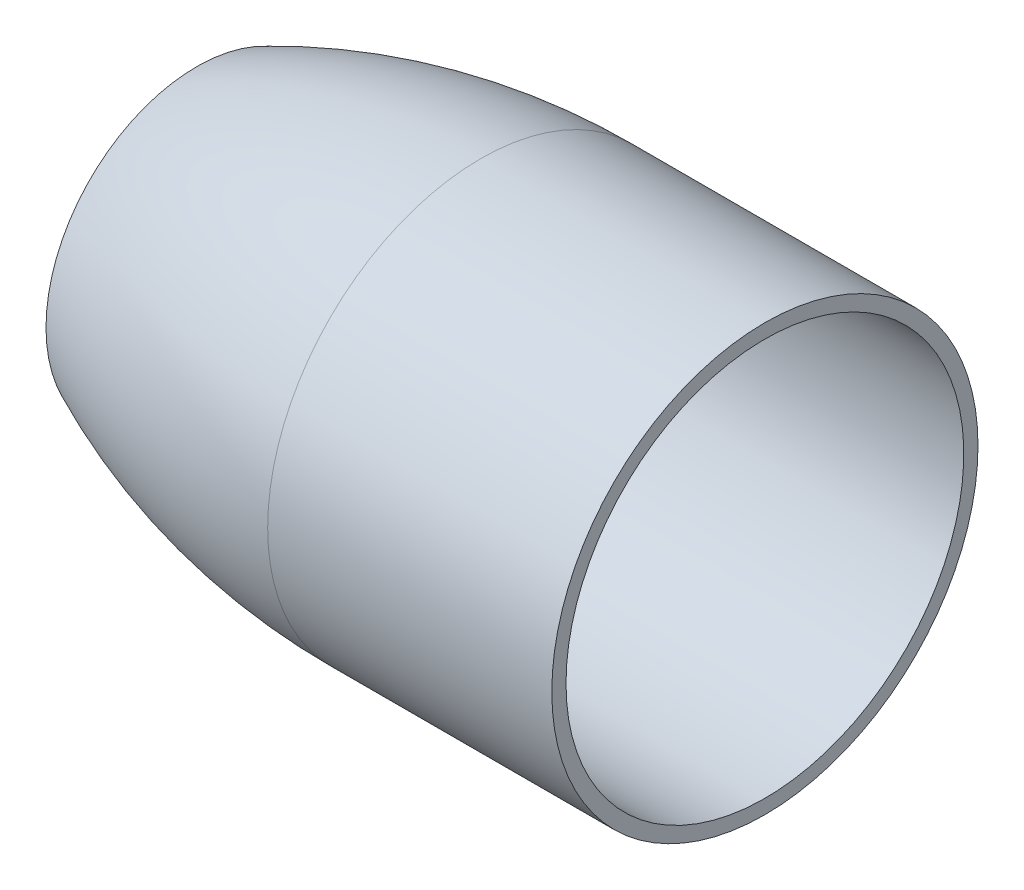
from build123d import *


with BuildPart() as part:
    # Sketch 1 → Revolve 1 (revolve)
    with BuildSketch(Plane.XY, mode=Mode.PRIVATE) as revolve_1_sk:
        with BuildLine():
            Line((0, 14), (0, 15))
            Line((0, 15), (-20, 15))
            ThreePointArc((-20, 15), (-30.238753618, 13.887934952), (-40, 10.603603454))
            Line((-40, 10.603603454), (-40, 9.499525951))
            ThreePointArc((-40, 9.499525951), (-30.250052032, 12.860988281), (-20, 14))
            Line((-20, 14), (0, 14))
        make_face()
    revolve(revolve_1_sk.sketch.rotate(Axis((-53.89093277, 0, 0), (1, 0, 0)), 90), axis=Axis((-53.89093277, 0, 0), (1, 0, 0)))


solid = part.part
